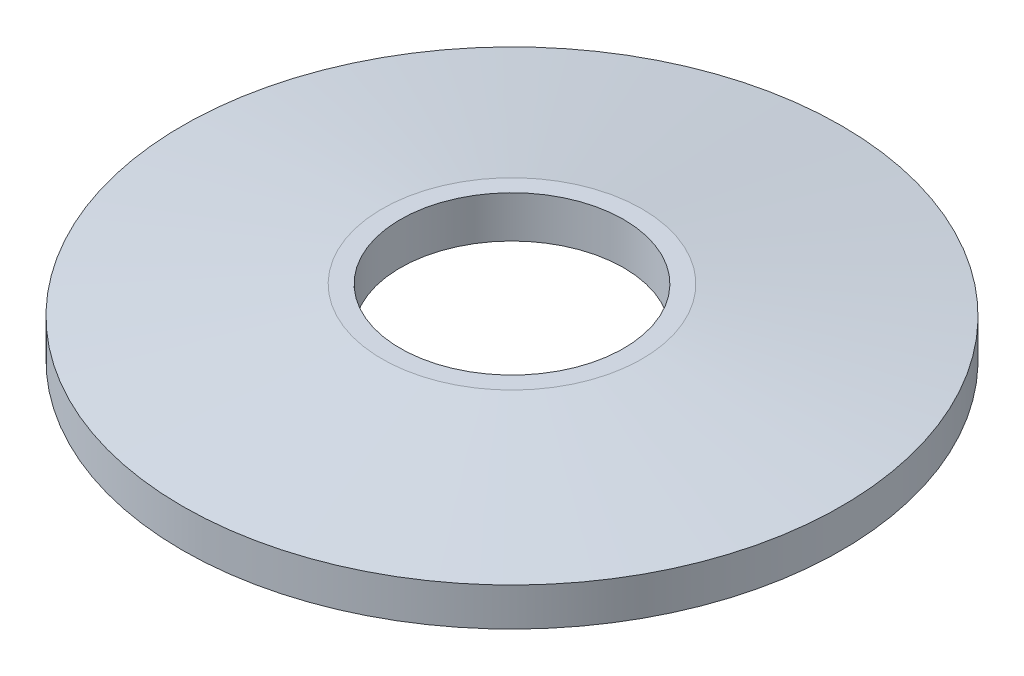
from build123d import *


with BuildPart() as part:
    # Esquisse1 → Base-R_volution (revolve)
    with BuildSketch(Plane.XY, mode=Mode.PRIVATE) as base_r_volution_sk:
        Polygon((3.05, 0), (3.05, -1.141897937), (7.78188739, -1.8), (9, -1.8), (9, -0.757862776), (3.55081284, 0), align=None)
    revolve(base_r_volution_sk.sketch.rotate(Axis((0, 0, 0), (0, 1, 0)), 90), axis=Axis((0, 0, 0), (0, 1, 0)))


solid = part.part
